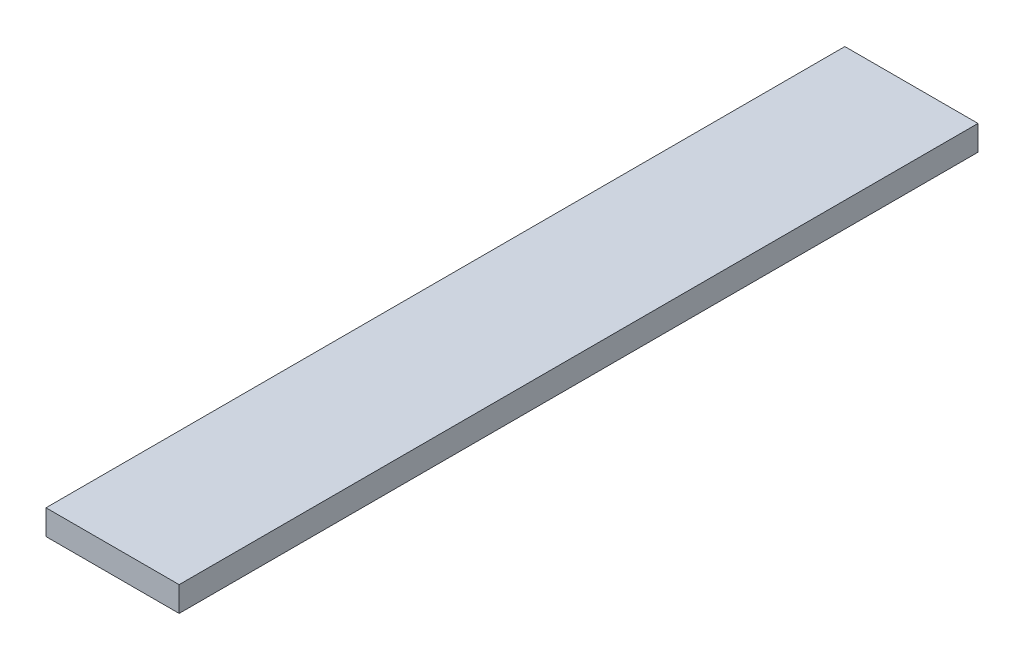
from build123d import *

# Parameters (mm, degrees)
SKETCH1_W           = 12.7
SKETCH1_H           = 76.2
BOSS_EXTRUDE1_DEPTH = 2.38125


with BuildPart() as part:
    # Sketch1 → Boss-Extrude1 (new body)
    with BuildSketch(Plane(origin=(0, 0, 0), x_dir=(1, 0, 0), z_dir=(0, 1, 0))):
        Rectangle(SKETCH1_W, SKETCH1_H)
    extrude(amount=BOSS_EXTRUDE1_DEPTH)


solid = part.part
